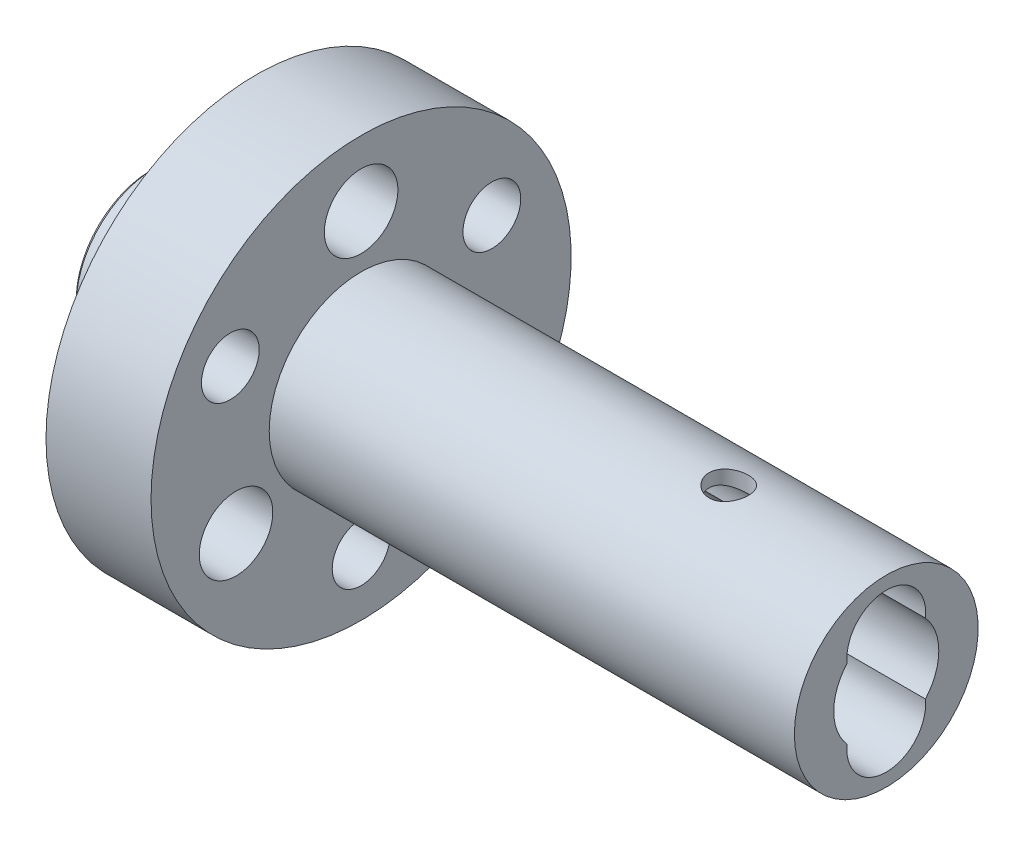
from build123d import *

# Parameters (mm, degrees)
F_2_8_2_8_DURCHMESSER_BOHRUNG1_D = 2.8
F_2_2_2_2_DURCHMESSER_BOHRUNG1_D = 2.2
KREISMUSTER1_COUNT               = 3
SKIZZE6_R                        = 0.75
LINEAR_AUSTRAGEN1_DEPTH          = 9.5
LINEAR_AUSTRAGEN2_DEPTH          = 10
FASE1_SIZE                       = 0.3
SKIZZE8_R                        = 2.5
LINEAR_AUSTRAGEN3_DEPTH          = 1
SKIZZE9_OUTSIDE_W                = 25.2
SKIZZE9_OUTSIDE_H                = 25.2
SKIZZE9_OUTSIDE_R                = 3
LINEAR_AUSTRAGEN4_DEPTH          = 4


with BuildPart() as part:
    # Skizze1 → Rotation1 (revolve)
    with BuildSketch(Plane.XY, mode=Mode.PRIVATE) as rotation1_sk:
        Polygon((0, 2.35), (1, 2.35), (1, 2), (28, 2), (28, 3.5), (8, 3.5), (8, 8), (4, 8), (4, 2.85), (3.2, 2.85), (3.2, 3.15), (0, 3.15), align=None)
    revolve(rotation1_sk.sketch.rotate(Axis((0, 0, 0), (1, 0, 0)), 90), axis=Axis((0, 0, 0), (1, 0, 0)))

    # 2.8 _2.8_ Durchmesser Bohrung1 (through all)
    with Locations(Plane.ZY.offset(-4)):
        with Locations((0, 5.5)):
            f_2_8_2_8_durchmesser_bohrung1 = Hole(F_2_8_2_8_DURCHMESSER_BOHRUNG1_D / 2)

    # 2.2 _2.2_ Durchmesser Bohrung1 (through all)
    with Locations(Plane.ZY.offset(-4)):
        with Locations((0, -5.75)):
            f_2_2_2_2_durchmesser_bohrung1 = Hole(F_2_2_2_2_DURCHMESSER_BOHRUNG1_D / 2)

    # Kreismuster1: 2.8 _2.8_ Durchmesser Bohrung1, 2.2 _2.2_ Durchmesser Bohrung1 ×3 about axis
    kreismuster1_axis = Axis((0, 0, 0), (1, 0, 0))
    add([f_2_8_2_8_durchmesser_bohrung1.rotate(kreismuster1_axis, i * 360 / KREISMUSTER1_COUNT) for i in range(1, KREISMUSTER1_COUNT)], mode=Mode.SUBTRACT)
    add([f_2_2_2_2_durchmesser_bohrung1.rotate(kreismuster1_axis, i * 360 / KREISMUSTER1_COUNT) for i in range(1, KREISMUSTER1_COUNT)], mode=Mode.SUBTRACT)

    # Skizze6 → Linear austragen1 (cut, symmetric)
    with BuildSketch(Plane(origin=(0, 0, 0), x_dir=(1, 0, 0), z_dir=(0, 1, 0))):
        with Locations(Location((22, 0, 0), (0, 0, 270))):
            Circle(SKIZZE6_R)
    extrude(amount=LINEAR_AUSTRAGEN1_DEPTH, both=True, mode=Mode.SUBTRACT)

    # Skizze7 → Linear austragen2 (cut)
    with BuildSketch(Plane(origin=(28, 0, 0), x_dir=(0, 0, -1), z_dir=(1, 0, 0))):
        with BuildLine():
            ThreePointArc((1.490711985, 1.333333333), (0, 3), (-1.490711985, 1.333333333))
            ThreePointArc((-1.490711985, 1.333333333), (-2, 0), (-1.490711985, -1.333333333))
            ThreePointArc((-1.490711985, -1.333333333), (0, -3), (1.490711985, -1.333333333))
            ThreePointArc((1.490711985, -1.333333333), (2, 0), (1.490711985, 1.333333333))
        make_face()
    extrude(amount=-LINEAR_AUSTRAGEN2_DEPTH, mode=Mode.SUBTRACT)

    # Fase1
    fase1_edges = [part.edges().sort_by_distance(p)[0] for p in [
        (0, 0, -3.15),
    ]]
    chamfer(fase1_edges, length=FASE1_SIZE)

    # Skizze8 → Linear austragen3 (cut)
    with BuildSketch(Plane.ZY):
        Circle(SKIZZE8_R)
    extrude(amount=-LINEAR_AUSTRAGEN3_DEPTH, mode=Mode.SUBTRACT)

    # Skizze9 outside → Linear austragen4 (cut)
    with BuildSketch(Plane.ZY):
        Rectangle(SKIZZE9_OUTSIDE_W, SKIZZE9_OUTSIDE_H)
        Circle(SKIZZE9_OUTSIDE_R, mode=Mode.SUBTRACT)
    extrude(amount=-LINEAR_AUSTRAGEN4_DEPTH, mode=Mode.SUBTRACT)


solid = part.part
